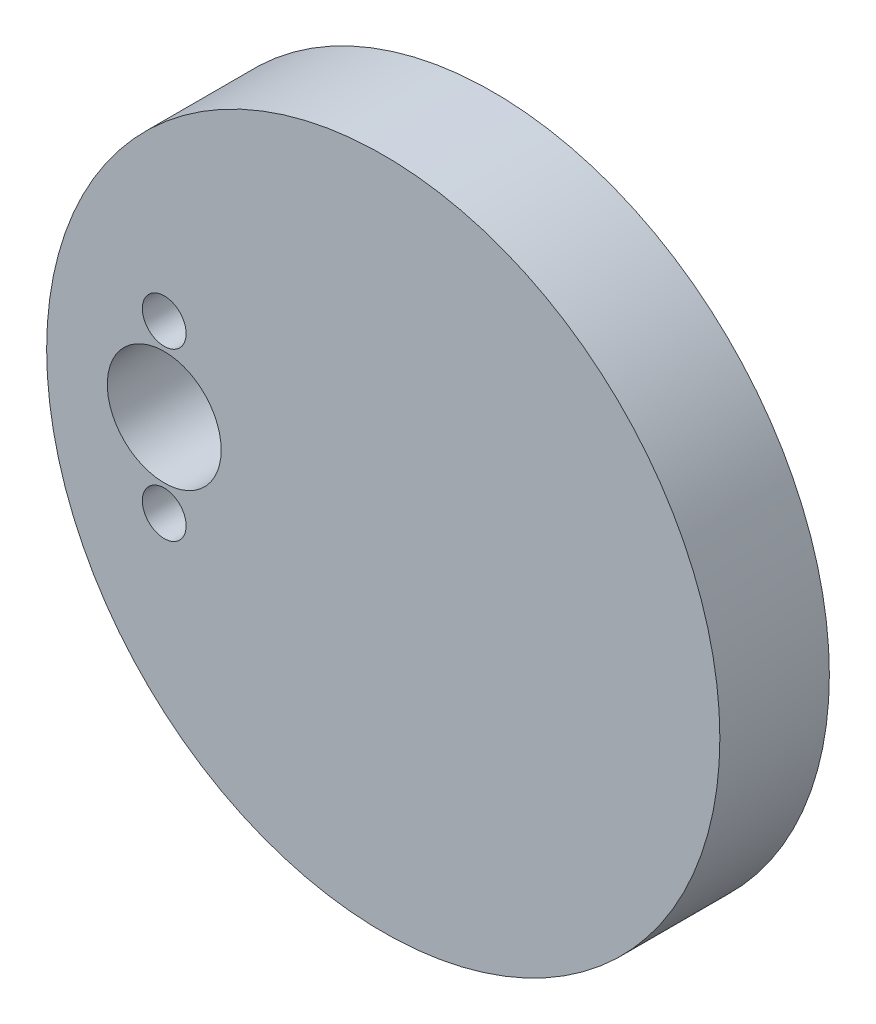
from build123d import *

# Parameters (mm, degrees)
SKETCH1_R           = 39.0398
SKETCH1_R_2         = 6.604
SKETCH1_R_3         = 2.54
BOSS_EXTRUDE1_DEPTH = 6.35


with BuildPart() as part:
    # Sketch1 → Boss-Extrude1 (new, symmetric)
    with BuildSketch(Plane.XY):
        Circle(SKETCH1_R)
        with Locations((-25.4, 0)):
            Circle(SKETCH1_R_2, mode=Mode.SUBTRACT)
        with Locations((-25.4, 9.652)):
            Circle(SKETCH1_R_3, mode=Mode.SUBTRACT)
        with Locations((-25.4, -9.652)):
            Circle(SKETCH1_R_3, mode=Mode.SUBTRACT)
    extrude(amount=BOSS_EXTRUDE1_DEPTH, both=True)


solid = part.part
